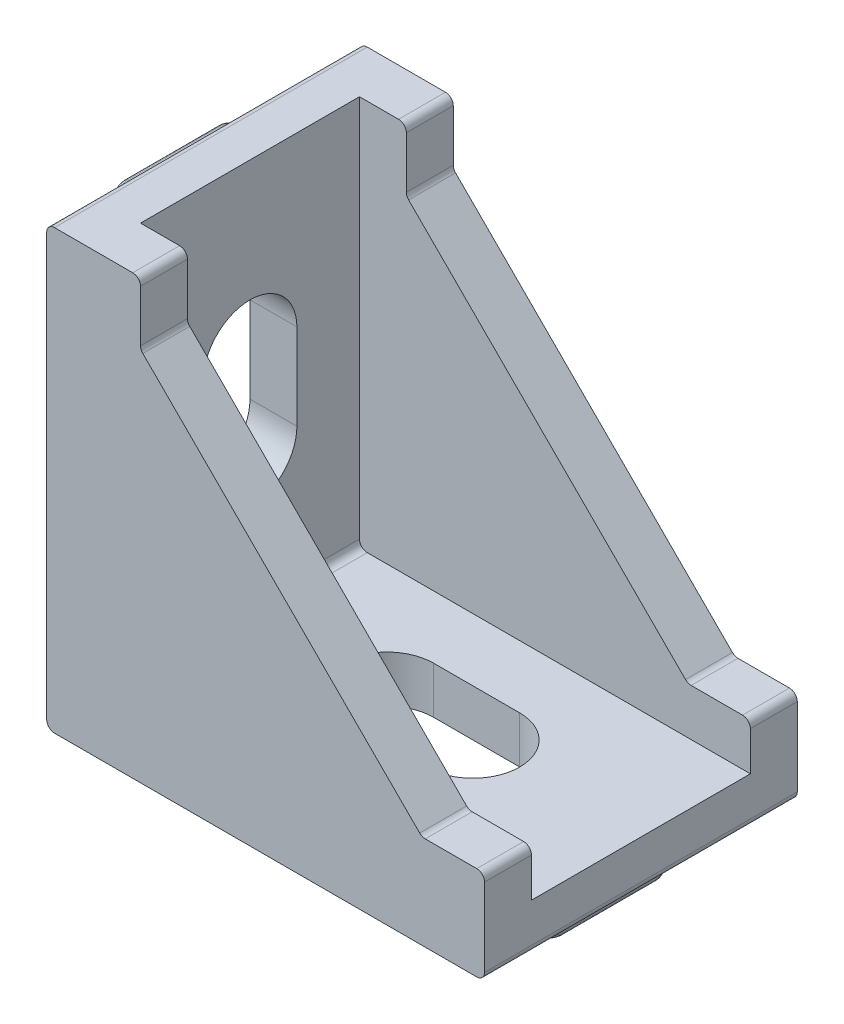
from build123d import *

# Parameters (mm, degrees)
BOSS_EXTRUDE1_DEPTH = 20
SKETCH2_W           = 25
SKETCH2_H           = 14
CUT_EXTRUDE1_DEPTH  = 25
CUT_EXTRUDE2_DEPTH  = 38.148351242
BOSS_EXTRUDE2_DEPTH = 2
FILLET4_R           = 0.5
FILLET5_R           = 0.2


with BuildPart() as part:
    # Sketch1 → Boss-Extrude1 (new body)
    with BuildSketch(Plane.XY):
        Polygon((-8, 10), (-8, 14), (-14, 14), (-14, -14), (14, -14), (14, -8), (10, -8), align=None)
    extrude(amount=BOSS_EXTRUDE1_DEPTH)

    # Sketch2 → Cut-Extrude1 (cut)
    with BuildSketch(Plane(origin=(0, 14, 0), x_dir=(1, 0, 0), z_dir=(0, 1, 0))):
        with Locations((1.5, -10)):
            Rectangle(SKETCH2_W, SKETCH2_H)
    extrude(amount=-CUT_EXTRUDE1_DEPTH, mode=Mode.SUBTRACT)

    # Sketch3 → Cut-Extrude2 (cut, through all)
    with BuildSketch(Plane.XZ.offset(14)):
        with BuildLine():
            Line((-2.25, 13), (3.25, 13))
            ThreePointArc((3.25, 13), (6.25, 10), (3.25, 7))
            Line((3.25, 7), (-2.25, 7))
            ThreePointArc((-2.25, 7), (-5.25, 10), (-2.25, 13))
        make_face()
    cut_extrude2 = extrude(amount=-CUT_EXTRUDE2_DEPTH, mode=Mode.SUBTRACT)

    # Mirror1: Cut-Extrude2 across plane
    add(cut_extrude2.mirror(Plane(origin=(0, 0, 0), x_dir=(0, 0, 1), z_dir=(-0.7071067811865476, 0.7071067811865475, 0))), mode=Mode.SUBTRACT)

    # Sketch4 → Boss-Extrude2 (add)
    with BuildSketch(Plane.ZY.offset(14)):
        with BuildLine():
            Line((7, 12), (13, 12))
            ThreePointArc((13, 12), (14, 11), (13, 10))
            Line((13, 10), (7, 10))
            ThreePointArc((7, 10), (6, 11), (7, 12))
        make_face()
        with BuildLine():
            Line((7, -12), (13, -12))
            ThreePointArc((13, -12), (14, -11), (13, -10))
            Line((13, -10), (7, -10))
            ThreePointArc((7, -10), (6, -11), (7, -12))
        make_face()
    boss_extrude2 = extrude(amount=BOSS_EXTRUDE2_DEPTH)

    # Mirror4: Boss-Extrude2 across plane
    add(boss_extrude2.mirror(Plane(origin=(0, 0, 0), x_dir=(0, 0, 1), z_dir=(-0.7071067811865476, 0.7071067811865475, 0))))

    # Fillet4
    fillet4_edges = [part.edges().sort_by_distance(p)[0] for p in [
        (14, -8, 18.5),
        (14, -14, 10),
        (-14, -14, 10),
        (-14, 14, 10),
        (-8, 14, 18.5),
        (-8, 10, 18.5),
        (10, -8, 18.5),
        (14, -8, 1.5),
        (-8, 14, 1.5),
        (-8, 10, 1.5),
        (10, -8, 1.5),
        (-11, -11, 10),
    ]]
    fillet(fillet4_edges, radius=FILLET4_R)

    # Fillet5
    fillet5_edges = [part.edges().sort_by_distance(p)[0] for p in [
        (-16, -11, 6),
        (-16, -12, 10),
        (-16, -11, 14),
        (-16, -10, 10),
        (11, -16, 6),
        (12, -16, 10),
        (11, -16, 14),
        (10, -16, 10),
        (-11, -16, 6),
        (-10, -16, 10),
        (-11, -16, 14),
        (-12, -16, 10),
        (-16, 11, 6),
        (-16, 10, 10),
        (-16, 11, 14),
        (-16, 12, 10),
    ]]
    fillet(fillet5_edges, radius=FILLET5_R)


solid = part.part
